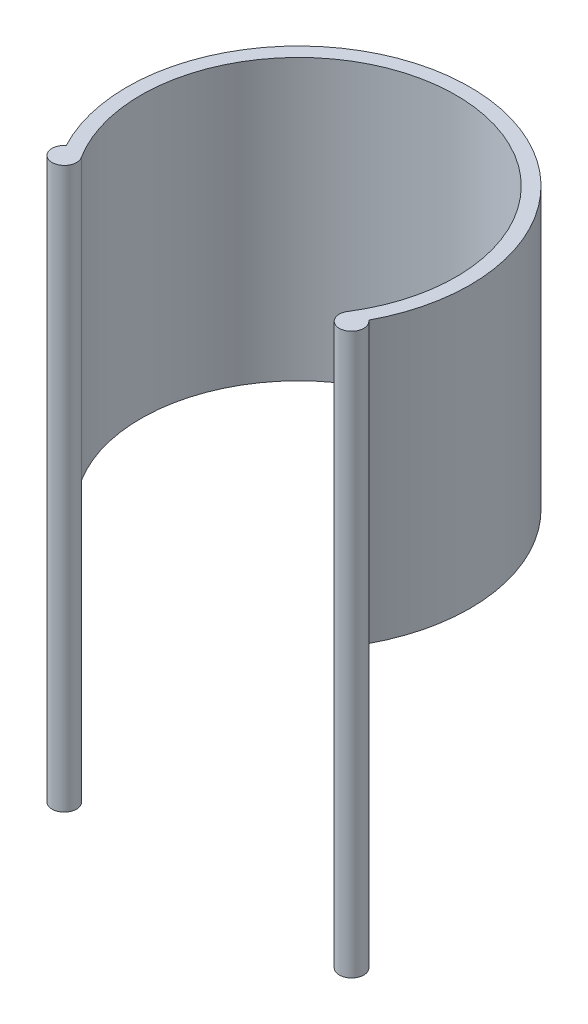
ISO-10303-21;
HEADER;
FILE_DESCRIPTION(('STEP AP214'),'2;1');
FILE_NAME('part.step','',(''),(''),'','','');
FILE_SCHEMA(('AUTOMOTIVE_DESIGN { 1 0 10303 214 1 1 1 1 }'));
ENDSEC;
DATA;
#1=APPLICATION_CONTEXT('core data for automotive mechanical design processes');
#2=APPLICATION_PROTOCOL_DEFINITION('international standard','automotive_design',2000,#1);
#3=PRODUCT_CONTEXT('',#1,'mechanical');
#4=PRODUCT('Part','Part','',(#3));
#5=PRODUCT_RELATED_PRODUCT_CATEGORY('part','',(#4));
#6=PRODUCT_DEFINITION_FORMATION('','',#4);
#7=PRODUCT_DEFINITION_CONTEXT('part definition',#1,'design');
#8=PRODUCT_DEFINITION('design','',#6,#7);
#9=PRODUCT_DEFINITION_SHAPE('','',#8);
#10=(LENGTH_UNIT() NAMED_UNIT(*) SI_UNIT(.MILLI.,.METRE.));
#11=(NAMED_UNIT(*) PLANE_ANGLE_UNIT() SI_UNIT($,.RADIAN.));
#12=(NAMED_UNIT(*) SI_UNIT($,.STERADIAN.) SOLID_ANGLE_UNIT());
#13=UNCERTAINTY_MEASURE_WITH_UNIT(LENGTH_MEASURE(1.E-05),#10,'distance_accuracy_value','');
#14=(GEOMETRIC_REPRESENTATION_CONTEXT(3) GLOBAL_UNCERTAINTY_ASSIGNED_CONTEXT((#13)) GLOBAL_UNIT_ASSIGNED_CONTEXT((#10,
#11,#12)) REPRESENTATION_CONTEXT('',''));
#15=CARTESIAN_POINT('',(0.,0.,0.));
#16=DIRECTION('',(0.,0.,1.));
#17=DIRECTION('',(1.,0.,0.));
#18=AXIS2_PLACEMENT_3D('',#15,#16,#17);
#19=CARTESIAN_POINT('',(0.,40.,0.));
#20=DIRECTION('',(0.,-1.,0.));
#21=DIRECTION('',(0.,0.,-1.));
#22=AXIS2_PLACEMENT_3D('',#19,#20,#21);
#23=CYLINDRICAL_SURFACE('',#22,24.5);
#24=DIRECTION('',(0.,1.,0.));
#25=VECTOR('',#24,1.);
#26=CARTESIAN_POINT('',(21.6002344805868,0.,11.5620011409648));
#27=LINE('',#26,#25);
#28=CARTESIAN_POINT('',(21.6002344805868,0.,11.5620011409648));
#29=VERTEX_POINT('',#28);
#30=CARTESIAN_POINT('',(21.6002344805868,40.,11.5620011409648));
#31=VERTEX_POINT('',#30);
#32=EDGE_CURVE('E70',#29,#31,#27,.T.);
#33=ORIENTED_EDGE('',*,*,#32,.F.);
#34=CARTESIAN_POINT('',(0.,0.,0.));
#35=DIRECTION('',(0.,1.,0.));
#36=DIRECTION('',(1.,0.,0.));
#37=AXIS2_PLACEMENT_3D('',#34,#35,#36);
#38=CIRCLE('',#37,24.5);
#39=CARTESIAN_POINT('',(-21.6002344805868,0.,11.5620011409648));
#40=VERTEX_POINT('',#39);
#41=EDGE_CURVE('E95',#40,#29,#38,.F.);
#42=ORIENTED_EDGE('',*,*,#41,.F.);
#43=DIRECTION('',(0.,1.,0.));
#44=VECTOR('',#43,1.);
#45=CARTESIAN_POINT('',(-21.6002344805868,0.,11.5620011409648));
#46=LINE('',#45,#44);
#47=CARTESIAN_POINT('',(-21.6002344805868,40.,11.5620011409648));
#48=VERTEX_POINT('',#47);
#49=EDGE_CURVE('E54',#48,#40,#46,.F.);
#50=ORIENTED_EDGE('',*,*,#49,.F.);
#51=CARTESIAN_POINT('',(0.,40.,0.));
#52=DIRECTION('',(0.,1.,0.));
#53=DIRECTION('',(1.,0.,0.));
#54=AXIS2_PLACEMENT_3D('',#51,#52,#53);
#55=CIRCLE('',#54,24.5);
#56=EDGE_CURVE('E86',#48,#31,#55,.F.);
#57=ORIENTED_EDGE('',*,*,#56,.T.);
#58=EDGE_LOOP('',(#33,#42,#50,#57));
#59=FACE_BOUND('',#58,.T.);
#60=ADVANCED_FACE('F33',(#59),#23,.T.);
#61=CARTESIAN_POINT('',(0.,40.,0.));
#62=DIRECTION('',(0.,-1.,0.));
#63=DIRECTION('',(0.,0.,-1.));
#64=AXIS2_PLACEMENT_3D('',#61,#62,#63);
#65=CYLINDRICAL_SURFACE('',#64,22.5);
#66=CARTESIAN_POINT('',(0.,0.,0.));
#67=DIRECTION('',(0.,-1.,0.));
#68=DIRECTION('',(0.,0.,1.));
#69=AXIS2_PLACEMENT_3D('',#66,#67,#68);
#70=CIRCLE('',#69,22.5);
#71=CARTESIAN_POINT('',(-19.0601395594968,0.,11.9566333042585));
#72=VERTEX_POINT('',#71);
#73=CARTESIAN_POINT('',(19.0601395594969,0.,11.9566333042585));
#74=VERTEX_POINT('',#73);
#75=EDGE_CURVE('E91',#72,#74,#70,.T.);
#76=ORIENTED_EDGE('',*,*,#75,.T.);
#77=DIRECTION('',(0.,1.,0.));
#78=VECTOR('',#77,1.);
#79=CARTESIAN_POINT('',(19.0601395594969,0.,11.9566333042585));
#80=LINE('',#79,#78);
#81=CARTESIAN_POINT('',(19.0601395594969,40.,11.9566333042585));
#82=VERTEX_POINT('',#81);
#83=EDGE_CURVE('E47',#74,#82,#80,.T.);
#84=ORIENTED_EDGE('',*,*,#83,.T.);
#85=CARTESIAN_POINT('',(0.,40.,0.));
#86=DIRECTION('',(0.,-1.,0.));
#87=DIRECTION('',(0.,0.,1.));
#88=AXIS2_PLACEMENT_3D('',#85,#86,#87);
#89=CIRCLE('',#88,22.5);
#90=CARTESIAN_POINT('',(-19.0601395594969,40.,11.9566333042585));
#91=VERTEX_POINT('',#90);
#92=EDGE_CURVE('E88',#91,#82,#89,.T.);
#93=ORIENTED_EDGE('',*,*,#92,.F.);
#94=DIRECTION('',(0.,1.,0.));
#95=VECTOR('',#94,1.);
#96=CARTESIAN_POINT('',(-19.0601395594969,0.,11.9566333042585));
#97=LINE('',#96,#95);
#98=EDGE_CURVE('E105',#91,#72,#97,.F.);
#99=ORIENTED_EDGE('',*,*,#98,.T.);
#100=EDGE_LOOP('',(#76,#84,#93,#99));
#101=FACE_BOUND('',#100,.T.);
#102=ADVANCED_FACE('F107',(#101),#65,.F.);
#103=CARTESIAN_POINT('',(20.5125165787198,40.,12.9329022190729));
#104=DIRECTION('',(0.,1.,0.));
#105=DIRECTION('',(1.,0.,0.));
#106=AXIS2_PLACEMENT_3D('',#103,#104,#105);
#107=PLANE('',#106);
#108=ORIENTED_EDGE('',*,*,#92,.T.);
#109=CARTESIAN_POINT('',(20.5125165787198,40.,12.9329022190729));
#110=DIRECTION('',(0.,1.,0.));
#111=DIRECTION('',(0.,0.,1.));
#112=AXIS2_PLACEMENT_3D('',#109,#110,#111);
#113=CIRCLE('',#112,1.75);
#114=EDGE_CURVE('E74',#82,#31,#113,.T.);
#115=ORIENTED_EDGE('',*,*,#114,.T.);
#116=ORIENTED_EDGE('',*,*,#56,.F.);
#117=CARTESIAN_POINT('',(-20.5125165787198,40.,12.9329022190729));
#118=DIRECTION('',(0.,1.,0.));
#119=DIRECTION('',(0.,0.,1.));
#120=AXIS2_PLACEMENT_3D('',#117,#118,#119);
#121=CIRCLE('',#120,1.75);
#122=EDGE_CURVE('E79',#48,#91,#121,.T.);
#123=ORIENTED_EDGE('',*,*,#122,.T.);
#124=EDGE_LOOP('',(#108,#115,#116,#123));
#125=FACE_BOUND('',#124,.T.);
#126=ADVANCED_FACE('F84',(#125),#107,.T.);
#127=CARTESIAN_POINT('',(20.5125165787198,0.,12.9329022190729));
#128=DIRECTION('',(0.,1.,0.));
#129=DIRECTION('',(1.,0.,0.));
#130=AXIS2_PLACEMENT_3D('',#127,#128,#129);
#131=PLANE('',#130);
#132=ORIENTED_EDGE('',*,*,#41,.T.);
#133=CARTESIAN_POINT('',(20.5125165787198,0.,12.9329022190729));
#134=DIRECTION('',(0.,1.,0.));
#135=DIRECTION('',(0.,0.,1.));
#136=AXIS2_PLACEMENT_3D('',#133,#134,#135);
#137=CIRCLE('',#136,1.75);
#138=EDGE_CURVE('E11',#29,#74,#137,.T.);
#139=ORIENTED_EDGE('',*,*,#138,.T.);
#140=ORIENTED_EDGE('',*,*,#75,.F.);
#141=CARTESIAN_POINT('',(-20.5125165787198,0.,12.9329022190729));
#142=DIRECTION('',(0.,1.,0.));
#143=DIRECTION('',(0.,0.,1.));
#144=AXIS2_PLACEMENT_3D('',#141,#142,#143);
#145=CIRCLE('',#144,1.75);
#146=EDGE_CURVE('E40',#72,#40,#145,.T.);
#147=ORIENTED_EDGE('',*,*,#146,.T.);
#148=EDGE_LOOP('',(#132,#139,#140,#147));
#149=FACE_BOUND('',#148,.T.);
#150=ADVANCED_FACE('F102',(#149),#131,.F.);
#151=CARTESIAN_POINT('',(-20.5125165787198,-40.,12.9329022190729));
#152=DIRECTION('',(0.,1.,0.));
#153=DIRECTION('',(0.,0.,1.));
#154=AXIS2_PLACEMENT_3D('',#151,#152,#153);
#155=CYLINDRICAL_SURFACE('',#154,1.75);
#156=CARTESIAN_POINT('',(-20.5125165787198,-40.,12.9329022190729));
#157=DIRECTION('',(0.,1.,0.));
#158=DIRECTION('',(0.,0.,1.));
#159=AXIS2_PLACEMENT_3D('',#156,#157,#158);
#160=CIRCLE('',#159,1.75);
#161=CARTESIAN_POINT('',(-20.5125165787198,-40.,14.6829022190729));
#162=VERTEX_POINT('',#161);
#163=EDGE_CURVE('E108',#162,#162,#160,.T.);
#164=ORIENTED_EDGE('',*,*,#163,.T.);
#165=EDGE_LOOP('',(#164));
#166=FACE_BOUND('',#165,.T.);
#167=ORIENTED_EDGE('',*,*,#122,.F.);
#168=ORIENTED_EDGE('',*,*,#49,.T.);
#169=ORIENTED_EDGE('',*,*,#146,.F.);
#170=ORIENTED_EDGE('',*,*,#98,.F.);
#171=EDGE_LOOP('',(#167,#168,#169,#170));
#172=FACE_BOUND('',#171,.T.);
#173=ADVANCED_FACE('F104',(#166,#172),#155,.T.);
#174=CARTESIAN_POINT('',(-20.5125165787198,-40.,12.9329022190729));
#175=DIRECTION('',(0.,1.,0.));
#176=DIRECTION('',(0.,0.,1.));
#177=AXIS2_PLACEMENT_3D('',#174,#175,#176);
#178=PLANE('',#177);
#179=ORIENTED_EDGE('',*,*,#163,.F.);
#180=EDGE_LOOP('',(#179));
#181=FACE_BOUND('',#180,.T.);
#182=ADVANCED_FACE('F123',(#181),#178,.F.);
#183=CARTESIAN_POINT('',(20.5125165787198,-40.,12.9329022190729));
#184=DIRECTION('',(0.,1.,0.));
#185=DIRECTION('',(0.,0.,1.));
#186=AXIS2_PLACEMENT_3D('',#183,#184,#185);
#187=CYLINDRICAL_SURFACE('',#186,1.75);
#188=ORIENTED_EDGE('',*,*,#138,.F.);
#189=ORIENTED_EDGE('',*,*,#32,.T.);
#190=ORIENTED_EDGE('',*,*,#114,.F.);
#191=ORIENTED_EDGE('',*,*,#83,.F.);
#192=EDGE_LOOP('',(#188,#189,#190,#191));
#193=FACE_BOUND('',#192,.T.);
#194=CARTESIAN_POINT('',(20.5125165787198,-40.,12.9329022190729));
#195=DIRECTION('',(0.,1.,0.));
#196=DIRECTION('',(0.,0.,1.));
#197=AXIS2_PLACEMENT_3D('',#194,#195,#196);
#198=CIRCLE('',#197,1.75);
#199=CARTESIAN_POINT('',(20.5125165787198,-40.,14.6829022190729));
#200=VERTEX_POINT('',#199);
#201=EDGE_CURVE('E89',#200,#200,#198,.T.);
#202=ORIENTED_EDGE('',*,*,#201,.T.);
#203=EDGE_LOOP('',(#202));
#204=FACE_BOUND('',#203,.T.);
#205=ADVANCED_FACE('F72',(#193,#204),#187,.T.);
#206=CARTESIAN_POINT('',(20.5125165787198,-40.,12.9329022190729));
#207=DIRECTION('',(0.,1.,0.));
#208=DIRECTION('',(0.,0.,1.));
#209=AXIS2_PLACEMENT_3D('',#206,#207,#208);
#210=PLANE('',#209);
#211=ORIENTED_EDGE('',*,*,#201,.F.);
#212=EDGE_LOOP('',(#211));
#213=FACE_BOUND('',#212,.T.);
#214=ADVANCED_FACE('F117',(#213),#210,.F.);
#215=CLOSED_SHELL('',(#60,#102,#126,#150,#173,#182,#205,#214));
#216=MANIFOLD_SOLID_BREP('B2',#215);
#217=ADVANCED_BREP_SHAPE_REPRESENTATION('',(#18,#216),#14);
#218=SHAPE_DEFINITION_REPRESENTATION(#9,#217);
ENDSEC;
END-ISO-10303-21;
